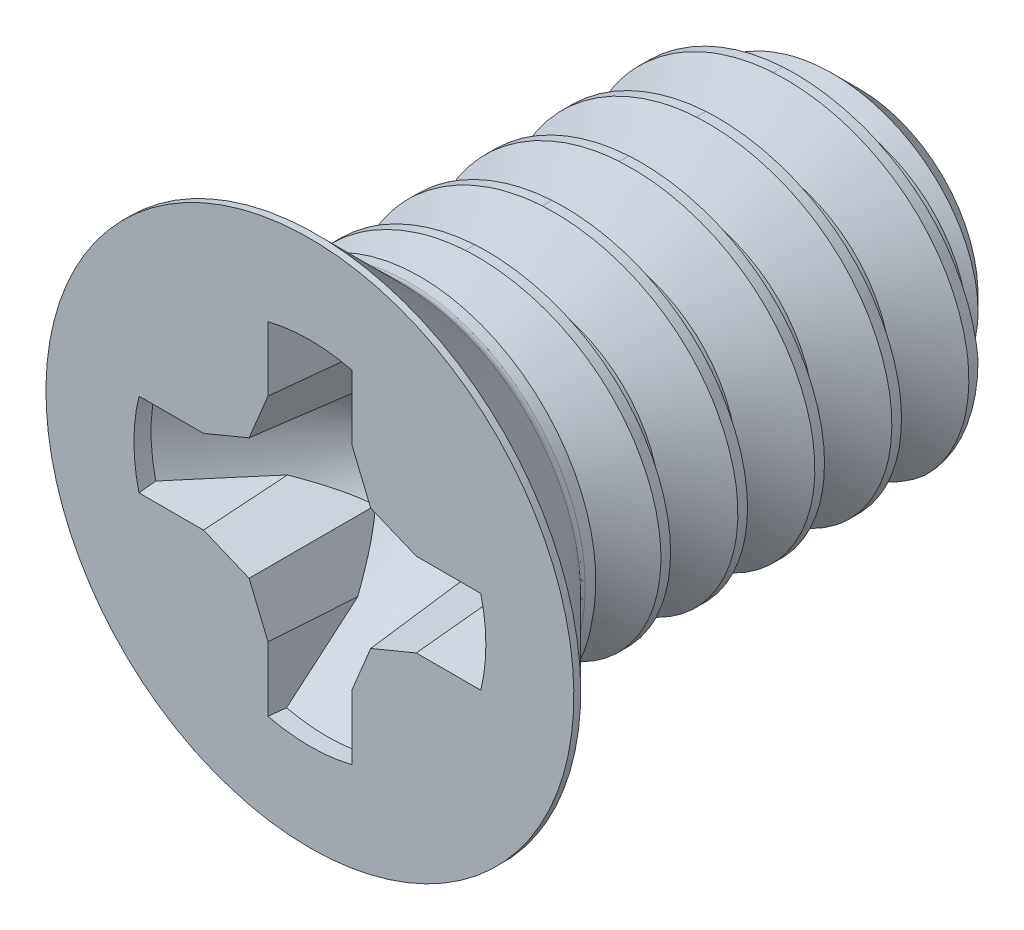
from build123d import *

# Parameters (mm, degrees)
CUT_EXTRUDE1_REACH     = 5.022
CIRPATTERN1_COUNT      = 4
DRAFT2_ANGLE           = 5.000000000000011
FILLET1_R              = 0.05
CUT_SWEEP1_PITCH       = 0.34999999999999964
CUT_SWEEP1_HEIGHT      = 2.4999999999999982
CUT_SWEEP1_RADIUS      = 0.8000000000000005
CUT_SWEEP1_START_ANGLE = 90.00000000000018


with BuildPart() as part:
    # Sketch3 → Revolve1 (revolve)
    with BuildSketch(Plane(origin=(0, 0, 0), x_dir=(0, 0, -1), z_dir=(1, 0, 0)), mode=Mode.PRIVATE) as revolve1_sk:
        Polygon((-0.5000000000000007, 1.2), (-0.5, -6e-17), (-0.06875000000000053, 5e-17), (-0.06875000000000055, 0.8), (-0.4687500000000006, 1.2000000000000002), align=None)
    revolve(revolve1_sk.sketch.rotate(Axis((0, -6e-17, 0.5), (0, 2.6e-16, -1)), 180), axis=Axis((0, -6e-17, 0.5), (0, 2.6e-16, -1)))

    # Sketch5 → Revolve2 (revolve)
    with BuildSketch(Plane(origin=(0, 0, 0), x_dir=(0, 0, -1), z_dir=(1, 0, 0))):
        Polygon((2, 0), (-0.06875000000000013, -2.2e-16), (-0.06875000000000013, 0.8), (1.7375, 0.7999999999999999), (2, 0.5375000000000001), align=None)
    revolve(axis=Axis((0, 0, -2), (0, -1e-16, 1)))

    # Cut-Extrude1: up to this cone (the profile starts inside it)
    cut_extrude1_end = Plane(origin=(0, -6e-17, 0.4999999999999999), z_dir=(0, -2.6e-16, 1)).offset(-0.8776956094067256) * Cone(1.00000000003e-06, 7.2773932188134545, 7.277392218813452, align=(Align.CENTER, Align.CENTER, Align.MIN), mode=Mode.PRIVATE)
    # Sketch4 → Cut-Extrude1 (cut, up to the surface)
    with BuildSketch(Plane.XY.offset(0.5000000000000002), mode=Mode.PRIVATE) as cut_extrude1_sk1:
        with BuildLine():
            Line((0, 1.1e-16), (0.8, 3.3e-16))
            ThreePointArc((0.8, 3.3e-16), (0.7942260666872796, 0.09594245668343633), (0.7769876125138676, 0.19050000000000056))
            Line((0.7769876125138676, 0.19050000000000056), (0.483743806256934, 0.19050000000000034))
            Line((0.483743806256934, 0.19050000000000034), (0.276389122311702, 0.27638912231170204))
            Line((0.276389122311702, 0.27638912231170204), (0.1905000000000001, 0.483743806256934))
            Line((0.1905000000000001, 0.483743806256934), (0.19050000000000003, 0.7769876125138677))
            ThreePointArc((0.19050000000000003, 0.7769876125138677), (0.09594245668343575, 0.7942260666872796), (-1e-16, 0.8))
            Line((-1e-16, 0.8), (0, 1.1e-16))
        make_face()
    cut_extrude1_tool1 = extrude(cut_extrude1_sk1.sketch, amount=-CUT_EXTRUDE1_REACH, mode=Mode.PRIVATE) & cut_extrude1_end
    cut_extrude1 = cut_extrude1_tool1.solids().sort_by_distance((0.266204, 0.266204, 0.5))[0]
    add(cut_extrude1, mode=Mode.SUBTRACT)

    # CirPattern1: Cut-Extrude1 ×4 about axis
    cirpattern1_axis = Axis((0, 0, 0), (0, 0, 1))
    for i in range(1, CIRPATTERN1_COUNT):
        add(cut_extrude1.rotate(cirpattern1_axis, i * 360 / CIRPATTERN1_COUNT), mode=Mode.SUBTRACT)

    # Draft2
    draft2_faces = [part.faces().sort_by_distance(p)[0] for p in [
        (-0.5990416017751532, 0.19050000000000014, 0.3756730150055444),
        (-0.37482053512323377, 0.23561749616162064, 0.28406649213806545),
        (-0.2356174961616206, 0.3748205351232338, 0.2840664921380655),
        (-0.19050000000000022, 0.5990416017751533, 0.37567301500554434),
        (0.19050000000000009, 0.5990416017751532, 0.3756730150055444),
        (0.2356174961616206, 0.37482053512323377, 0.28406649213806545),
        (0.3748205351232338, 0.23561749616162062, 0.2840664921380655),
        (0.5990416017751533, 0.19050000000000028, 0.37567301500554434),
        (0.5990416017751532, -0.19050000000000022, 0.3756730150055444),
        (0.3748205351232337, -0.2356174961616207, 0.28406649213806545),
        (0.23561749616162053, -0.3748205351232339, 0.2840664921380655),
        (0.19050000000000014, -0.5990416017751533, 0.37567301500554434),
        (-0.19050000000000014, -0.5990416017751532, 0.3756730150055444),
        (-0.23561749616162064, -0.37482053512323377, 0.28406649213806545),
        (-0.3748205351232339, -0.2356174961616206, 0.2840664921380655),
        (-0.5990416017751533, -0.19050000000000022, 0.37567301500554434),
    ]]
    draft(draft2_faces, Plane(origin=(0, -2.7e-16, 0.5000000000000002), x_dir=(0, 1, 2.6e-16), z_dir=(0, -2.6e-16, 1)), DRAFT2_ANGLE)

    # Fillet1
    fillet1_edges = [part.edges().sort_by_distance(p)[0] for p in [
        (0.7999999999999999, 3e-16, 0.06875000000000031),
    ]]
    fillet(fillet1_edges, radius=FILLET1_R)


with BuildPart() as body_2:
    # Split1: the piece on the far side of the plane
    add(part.part)
    split(bisect_by=Plane(origin=(0, 0, 0), x_dir=(0, -1, -9e-17), z_dir=(0, 9e-17, -1)), keep=Keep.BOTTOM)


with BuildPart() as part_1:
    add(part.part)

    # Split1
    split(bisect_by=Plane(origin=(0, 0, 0), x_dir=(0, -1, -9e-17), z_dir=(0, 9e-17, -1)), keep=Keep.TOP)

    # Cut-Sweep1: sweep along a helix
    with BuildLine() as cut_sweep1_path:
        add(Helix(CUT_SWEEP1_PITCH, CUT_SWEEP1_HEIGHT, CUT_SWEEP1_RADIUS, center=(0, -2.1e-16, -2), direction=(0, 0, 1), mode=Mode.PRIVATE).rotate(Axis((0, -2.1e-16, -2), (0, 0, 1)), CUT_SWEEP1_START_ANGLE))
    # Sketch7 → Cut-Sweep1 (sweep, cut)
    with BuildSketch(Plane(origin=(0, 0, 0), x_dir=(0, 0, -1), z_dir=(1, 0, 0))):
        Polygon((2.1750000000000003, 0.572668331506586), (2.13125, 0.572668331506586), (1.9890625, 0.8189443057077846), (2.3171875, 0.8189443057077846), align=None)
    sweep(path=cut_sweep1_path.line, is_frenet=True, mode=Mode.SUBTRACT)


with BuildPart() as body_2_1:
    add(body_2.part)

    # Combine1: union part
    add(part_1.part)


solid = body_2_1.part
